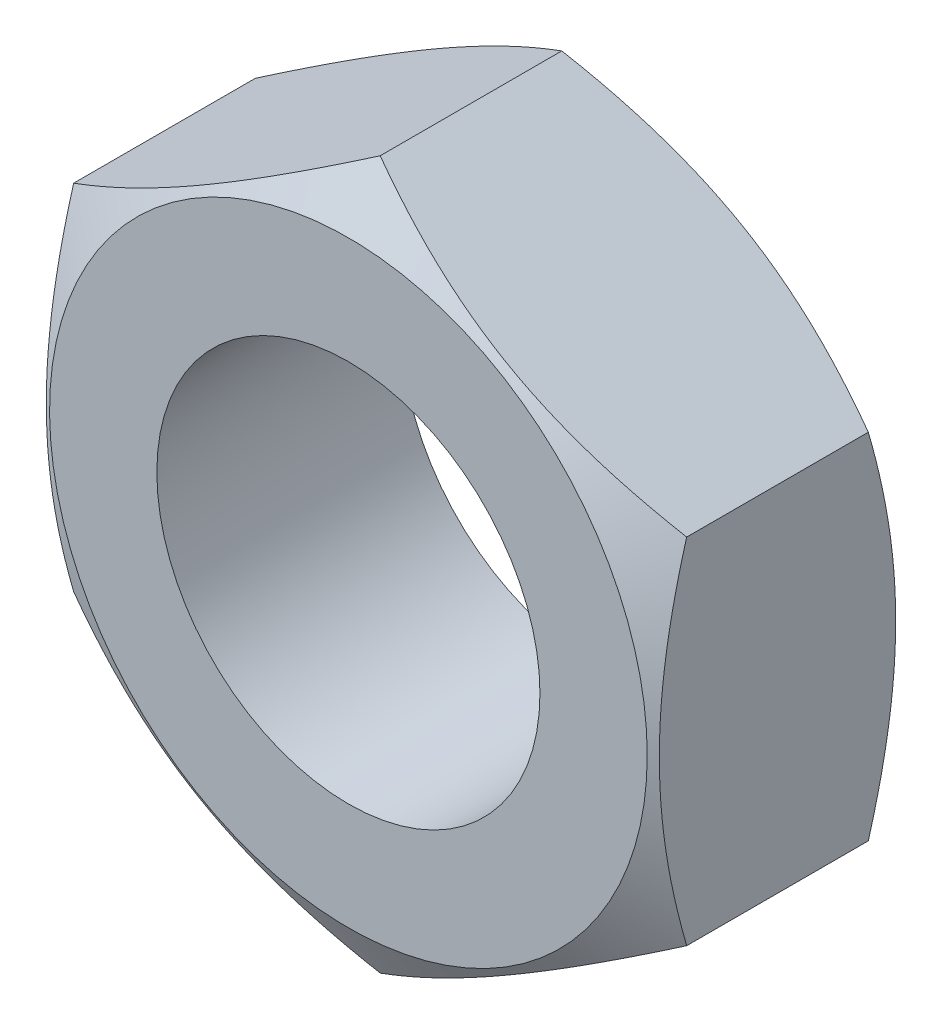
ISO-10303-21;
HEADER;
FILE_DESCRIPTION(('STEP AP214'),'2;1');
FILE_NAME('part.step','',(''),(''),'','','');
FILE_SCHEMA(('AUTOMOTIVE_DESIGN { 1 0 10303 214 1 1 1 1 }'));
ENDSEC;
DATA;
#1=APPLICATION_CONTEXT('core data for automotive mechanical design processes');
#2=APPLICATION_PROTOCOL_DEFINITION('international standard','automotive_design',2000,#1);
#3=PRODUCT_CONTEXT('',#1,'mechanical');
#4=PRODUCT('Part','Part','',(#3));
#5=PRODUCT_RELATED_PRODUCT_CATEGORY('part','',(#4));
#6=PRODUCT_DEFINITION_FORMATION('','',#4);
#7=PRODUCT_DEFINITION_CONTEXT('part definition',#1,'design');
#8=PRODUCT_DEFINITION('design','',#6,#7);
#9=PRODUCT_DEFINITION_SHAPE('','',#8);
#10=(LENGTH_UNIT() NAMED_UNIT(*) SI_UNIT(.MILLI.,.METRE.));
#11=(NAMED_UNIT(*) PLANE_ANGLE_UNIT() SI_UNIT($,.RADIAN.));
#12=(NAMED_UNIT(*) SI_UNIT($,.STERADIAN.) SOLID_ANGLE_UNIT());
#13=UNCERTAINTY_MEASURE_WITH_UNIT(LENGTH_MEASURE(1.E-05),#10,'distance_accuracy_value','');
#14=(GEOMETRIC_REPRESENTATION_CONTEXT(3) GLOBAL_UNCERTAINTY_ASSIGNED_CONTEXT((#13)) GLOBAL_UNIT_ASSIGNED_CONTEXT((#10,
#11,#12)) REPRESENTATION_CONTEXT('',''));
#15=CARTESIAN_POINT('',(0.,0.,0.));
#16=DIRECTION('',(0.,0.,1.));
#17=DIRECTION('',(1.,0.,0.));
#18=AXIS2_PLACEMENT_3D('',#15,#16,#17);
#19=CARTESIAN_POINT('',(4.,2.30940107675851,3.2));
#20=DIRECTION('',(-0.5,-0.866025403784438,0.));
#21=DIRECTION('',(0.866025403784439,-0.5,0.));
#22=AXIS2_PLACEMENT_3D('',#19,#20,#21);
#23=PLANE('',#22);
#24=CARTESIAN_POINT('',(-0.000199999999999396,4.61891762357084,0.415067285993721));
#25=CARTESIAN_POINT('',(0.17557915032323,4.5174314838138,0.356452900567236));
#26=CARTESIAN_POINT('',(0.352875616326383,4.41506932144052,0.303145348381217));
#27=CARTESIAN_POINT('',(0.710538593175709,4.2085725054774,0.210096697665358));
#28=CARTESIAN_POINT('',(0.890911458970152,4.10443418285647,0.170388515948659));
#29=CARTESIAN_POINT('',(1.24942181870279,3.89744813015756,0.108577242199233));
#30=CARTESIAN_POINT('',(1.42750415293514,3.7946322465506,0.0860627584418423));
#31=CARTESIAN_POINT('',(1.78450671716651,3.58851671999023,0.0591856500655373));
#32=CARTESIAN_POINT('',(1.96342564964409,3.48521782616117,0.0548007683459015));
#33=CARTESIAN_POINT('',(2.29774284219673,3.29219970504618,0.0639250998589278));
#34=CARTESIAN_POINT('',(2.45319115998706,3.20245157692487,0.0751939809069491));
#35=CARTESIAN_POINT('',(2.76307505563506,3.02354002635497,0.110909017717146));
#36=CARTESIAN_POINT('',(2.91750956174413,2.93437722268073,0.135367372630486));
#37=CARTESIAN_POINT('',(3.22803232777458,2.75509682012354,0.196511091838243));
#38=CARTESIAN_POINT('',(3.3840812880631,2.6650019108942,0.233455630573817));
#39=CARTESIAN_POINT('',(3.69385183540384,2.48615580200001,0.31730509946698));
#40=CARTESIAN_POINT('',(3.84757739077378,2.39740231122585,0.364190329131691));
#41=CARTESIAN_POINT('',(4.0002,2.30928560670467,0.415067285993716));
#42=B_SPLINE_CURVE_WITH_KNOTS('',3,(#24,#25,#26,#27,#28,#29,#30,#31,#32,#33,#34,#35,#36,#37,#38,
#39,#40,#41),.UNSPECIFIED.,.F.,.F.,(4,2,2,2,2,2,2,2,4),(0.,0.634047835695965,1.26961969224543,
1.88946157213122,2.50854226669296,3.04757825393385,3.58711366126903,4.13861653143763,
4.68903648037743),.UNSPECIFIED.);
#43=CARTESIAN_POINT('',(0.,4.618802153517,0.415000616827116));
#44=VERTEX_POINT('',#43);
#45=CARTESIAN_POINT('',(4.,2.30940107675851,0.415000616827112));
#46=VERTEX_POINT('',#45);
#47=EDGE_CURVE('E35',#44,#46,#42,.T.);
#48=ORIENTED_EDGE('',*,*,#47,.F.);
#49=DIRECTION('',(0.,0.,-1.));
#50=VECTOR('',#49,1.);
#51=CARTESIAN_POINT('',(0.,4.618802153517,3.2));
#52=LINE('',#51,#50);
#53=CARTESIAN_POINT('',(0.,4.618802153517,2.78499938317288));
#54=VERTEX_POINT('',#53);
#55=EDGE_CURVE('E28',#54,#44,#52,.T.);
#56=ORIENTED_EDGE('',*,*,#55,.F.);
#57=CARTESIAN_POINT('',(4.0002,2.30928560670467,2.78493271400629));
#58=CARTESIAN_POINT('',(3.82442084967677,2.41077174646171,2.84354709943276));
#59=CARTESIAN_POINT('',(3.64712438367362,2.513133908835,2.89685465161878));
#60=CARTESIAN_POINT('',(3.28946140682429,2.71963072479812,2.98990330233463));
#61=CARTESIAN_POINT('',(3.10908854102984,2.82376904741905,3.02961148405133));
#62=CARTESIAN_POINT('',(2.75057818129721,3.03075510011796,3.09142275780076));
#63=CARTESIAN_POINT('',(2.57249584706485,3.13357098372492,3.11393724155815));
#64=CARTESIAN_POINT('',(2.21549328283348,3.33968651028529,3.14081434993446));
#65=CARTESIAN_POINT('',(2.03657435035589,3.44298540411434,3.1451992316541));
#66=CARTESIAN_POINT('',(1.70225715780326,3.63600352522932,3.13607490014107));
#67=CARTESIAN_POINT('',(1.54680884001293,3.72575165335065,3.12480601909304));
#68=CARTESIAN_POINT('',(1.23692494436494,3.90466320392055,3.08909098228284));
#69=CARTESIAN_POINT('',(1.08249043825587,3.99382600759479,3.0646326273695));
#70=CARTESIAN_POINT('',(0.771967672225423,4.17310641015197,3.00348890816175));
#71=CARTESIAN_POINT('',(0.6159187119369,4.26320131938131,2.96654436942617));
#72=CARTESIAN_POINT('',(0.306148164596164,4.4420474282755,2.88269490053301));
#73=CARTESIAN_POINT('',(0.152422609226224,4.53080091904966,2.8358096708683));
#74=CARTESIAN_POINT('',(-0.000199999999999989,4.61891762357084,2.78493271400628));
#75=B_SPLINE_CURVE_WITH_KNOTS('',3,(#57,#58,#59,#60,#61,#62,#63,#64,#65,#66,#67,#68,#69,#70,#71,
#72,#73,#74),.UNSPECIFIED.,.F.,.F.,(4,2,2,2,2,2,2,2,4),(0.,0.634047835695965,1.26961969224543,
1.88946157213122,2.50854226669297,3.04757825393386,3.58711366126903,4.13861653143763,
4.68903648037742),.UNSPECIFIED.);
#76=CARTESIAN_POINT('',(4.,2.30940107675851,2.78499938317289));
#77=VERTEX_POINT('',#76);
#78=EDGE_CURVE('E113',#77,#54,#75,.T.);
#79=ORIENTED_EDGE('',*,*,#78,.F.);
#80=DIRECTION('',(0.,0.,-1.));
#81=VECTOR('',#80,1.);
#82=CARTESIAN_POINT('',(4.,2.30940107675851,3.2));
#83=LINE('',#82,#81);
#84=EDGE_CURVE('E90',#77,#46,#83,.T.);
#85=ORIENTED_EDGE('',*,*,#84,.T.);
#86=EDGE_LOOP('',(#48,#56,#79,#85));
#87=FACE_BOUND('',#86,.T.);
#88=ADVANCED_FACE('F14',(#87),#23,.F.);
#89=CARTESIAN_POINT('',(0.,4.618802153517,3.2));
#90=DIRECTION('',(0.5,-0.866025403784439,0.));
#91=DIRECTION('',(0.866025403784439,0.5,0.));
#92=AXIS2_PLACEMENT_3D('',#89,#90,#91);
#93=PLANE('',#92);
#94=CARTESIAN_POINT('',(-4.0002,2.30928560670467,0.415067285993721));
#95=CARTESIAN_POINT('',(-3.82442084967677,2.4107717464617,0.356452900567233));
#96=CARTESIAN_POINT('',(-3.64712438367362,2.51313390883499,0.303145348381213));
#97=CARTESIAN_POINT('',(-3.28946140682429,2.71963072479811,0.210096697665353));
#98=CARTESIAN_POINT('',(-3.10908854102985,2.82376904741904,0.170388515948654));
#99=CARTESIAN_POINT('',(-2.75057818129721,3.03075510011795,0.108577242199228));
#100=CARTESIAN_POINT('',(-2.57249584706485,3.13357098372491,0.086062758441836));
#101=CARTESIAN_POINT('',(-2.21549328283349,3.33968651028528,0.0591856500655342));
#102=CARTESIAN_POINT('',(-2.0365743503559,3.44298540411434,0.0548007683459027));
#103=CARTESIAN_POINT('',(-1.70225715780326,3.63600352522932,0.0639250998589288));
#104=CARTESIAN_POINT('',(-1.54680884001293,3.72575165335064,0.0751939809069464));
#105=CARTESIAN_POINT('',(-1.23692494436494,3.90466320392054,0.110909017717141));
#106=CARTESIAN_POINT('',(-1.08249043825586,3.99382600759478,0.135367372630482));
#107=CARTESIAN_POINT('',(-0.771967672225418,4.17310641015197,0.19651109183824));
#108=CARTESIAN_POINT('',(-0.615918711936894,4.26320131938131,0.233455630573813));
#109=CARTESIAN_POINT('',(-0.306148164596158,4.4420474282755,0.317305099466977));
#110=CARTESIAN_POINT('',(-0.152422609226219,4.53080091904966,0.364190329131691));
#111=CARTESIAN_POINT('',(0.000200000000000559,4.61891762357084,0.415067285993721));
#112=B_SPLINE_CURVE_WITH_KNOTS('',3,(#94,#95,#96,#97,#98,#99,#100,#101,#102,#103,#104,#105,#106,
#107,#108,#109,#110,#111),.UNSPECIFIED.,.F.,.F.,(4,2,2,2,2,2,2,2,4),(0.,0.634047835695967,
1.26961969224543,1.88946157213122,2.50854226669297,3.04757825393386,3.58711366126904,
4.13861653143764,4.68903648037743),.UNSPECIFIED.);
#113=CARTESIAN_POINT('',(-4.,2.30940107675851,0.415000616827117));
#114=VERTEX_POINT('',#113);
#115=EDGE_CURVE('E109',#114,#44,#112,.T.);
#116=ORIENTED_EDGE('',*,*,#115,.F.);
#117=DIRECTION('',(0.,0.,-1.));
#118=VECTOR('',#117,1.);
#119=CARTESIAN_POINT('',(-4.,2.30940107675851,3.2));
#120=LINE('',#119,#118);
#121=CARTESIAN_POINT('',(-4.,2.30940107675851,2.78499938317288));
#122=VERTEX_POINT('',#121);
#123=EDGE_CURVE('E100',#122,#114,#120,.T.);
#124=ORIENTED_EDGE('',*,*,#123,.F.);
#125=CARTESIAN_POINT('',(0.000200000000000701,4.61891762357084,2.78493271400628));
#126=CARTESIAN_POINT('',(-0.175579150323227,4.5174314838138,2.84354709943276));
#127=CARTESIAN_POINT('',(-0.35287561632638,4.41506932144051,2.89685465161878));
#128=CARTESIAN_POINT('',(-0.710538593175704,4.20857250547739,2.98990330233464));
#129=CARTESIAN_POINT('',(-0.890911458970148,4.10443418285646,3.02961148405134));
#130=CARTESIAN_POINT('',(-1.24942181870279,3.89744813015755,3.09142275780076));
#131=CARTESIAN_POINT('',(-1.42750415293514,3.79463224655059,3.11393724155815));
#132=CARTESIAN_POINT('',(-1.7845067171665,3.58851671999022,3.14081434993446));
#133=CARTESIAN_POINT('',(-1.9634256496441,3.48521782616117,3.1451992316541));
#134=CARTESIAN_POINT('',(-2.29774284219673,3.29219970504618,3.13607490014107));
#135=CARTESIAN_POINT('',(-2.45319115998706,3.20245157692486,3.12480601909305));
#136=CARTESIAN_POINT('',(-2.76307505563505,3.02354002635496,3.08909098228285));
#137=CARTESIAN_POINT('',(-2.91750956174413,2.93437722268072,3.06463262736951));
#138=CARTESIAN_POINT('',(-3.22803232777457,2.75509682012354,3.00348890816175));
#139=CARTESIAN_POINT('',(-3.3840812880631,2.6650019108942,2.96654436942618));
#140=CARTESIAN_POINT('',(-3.69385183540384,2.486155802,2.88269490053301));
#141=CARTESIAN_POINT('',(-3.84757739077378,2.39740231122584,2.8358096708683));
#142=CARTESIAN_POINT('',(-4.0002,2.30928560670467,2.78493271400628));
#143=B_SPLINE_CURVE_WITH_KNOTS('',3,(#125,#126,#127,#128,#129,#130,#131,#132,#133,#134,#135,
#136,#137,#138,#139,#140,#141,#142),.UNSPECIFIED.,.F.,.F.,(4,2,2,2,2,2,2,2,4),(0.,
0.634047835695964,1.26961969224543,1.88946157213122,2.50854226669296,3.04757825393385,
3.58711366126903,4.13861653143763,4.68903648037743),.UNSPECIFIED.);
#144=EDGE_CURVE('E110',#54,#122,#143,.T.);
#145=ORIENTED_EDGE('',*,*,#144,.F.);
#146=ORIENTED_EDGE('',*,*,#55,.T.);
#147=EDGE_LOOP('',(#116,#124,#145,#146));
#148=FACE_BOUND('',#147,.T.);
#149=ADVANCED_FACE('F107',(#148),#93,.F.);
#150=CARTESIAN_POINT('',(-4.,2.30940107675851,3.2));
#151=DIRECTION('',(1.,0.,0.));
#152=DIRECTION('',(0.,0.,-1.));
#153=AXIS2_PLACEMENT_3D('',#150,#151,#152);
#154=PLANE('',#153);
#155=CARTESIAN_POINT('',(-4.,-6.17590324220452,1.99654066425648));
#156=CARTESIAN_POINT('',(-4.,-6.00142542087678,1.91201394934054));
#157=CARTESIAN_POINT('',(-4.,-5.82654411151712,1.82830568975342));
#158=CARTESIAN_POINT('',(-4.,-5.47575983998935,1.66298695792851));
#159=CARTESIAN_POINT('',(-4.,-5.2998567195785,1.58137682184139));
#160=CARTESIAN_POINT('',(-4.,-4.94589460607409,1.42029874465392));
#161=CARTESIAN_POINT('',(-4.,-4.76782907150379,1.34084512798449));
#162=CARTESIAN_POINT('',(-4.,-4.41027208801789,1.18522627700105));
#163=CARTESIAN_POINT('',(-4.,-4.23078070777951,1.10906088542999));
#164=CARTESIAN_POINT('',(-4.,-3.86439909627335,0.958551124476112));
#165=CARTESIAN_POINT('',(-4.,-3.67745393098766,0.884339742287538));
#166=CARTESIAN_POINT('',(-4.,-3.30136630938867,0.741600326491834));
#167=CARTESIAN_POINT('',(-4.,-3.11222360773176,0.673072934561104));
#168=CARTESIAN_POINT('',(-4.,-2.73180305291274,0.543520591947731));
#169=CARTESIAN_POINT('',(-4.,-2.54053050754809,0.482480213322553));
#170=CARTESIAN_POINT('',(-4.,-2.15524197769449,0.369878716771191));
#171=CARTESIAN_POINT('',(-4.,-1.96122688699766,0.318314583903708));
#172=CARTESIAN_POINT('',(-4.,-1.57141523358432,0.227431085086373));
#173=CARTESIAN_POINT('',(-4.,-1.37563420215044,0.188046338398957));
#174=CARTESIAN_POINT('',(-4.,-0.981666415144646,0.123766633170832));
#175=CARTESIAN_POINT('',(-4.,-0.783479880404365,0.0988703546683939));
#176=CARTESIAN_POINT('',(-4.,-0.388268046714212,0.0658801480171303));
#177=CARTESIAN_POINT('',(-4.,-0.191261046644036,0.0575723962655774));
#178=CARTESIAN_POINT('',(-4.,0.202753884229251,0.0579024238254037));
#179=CARTESIAN_POINT('',(-4.,0.399761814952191,0.0665405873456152));
#180=CARTESIAN_POINT('',(-4.,0.735042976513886,0.095054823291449));
#181=CARTESIAN_POINT('',(-4.,0.87367778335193,0.110915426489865));
#182=CARTESIAN_POINT('',(-4.,1.14990838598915,0.150025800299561));
#183=CARTESIAN_POINT('',(-4.,1.28750403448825,0.173276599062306));
#184=CARTESIAN_POINT('',(-4.,1.69856274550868,0.252889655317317));
#185=CARTESIAN_POINT('',(-4.,1.97013891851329,0.319097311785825));
#186=CARTESIAN_POINT('',(-4.,2.37618130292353,0.433594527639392));
#187=CARTESIAN_POINT('',(-4.,2.51276006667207,0.47481634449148));
#188=CARTESIAN_POINT('',(-4.,2.78459027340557,0.561464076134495));
#189=CARTESIAN_POINT('',(-4.,2.91984170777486,0.606890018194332));
#190=CARTESIAN_POINT('',(-4.,3.18906161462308,0.701223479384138));
#191=CARTESIAN_POINT('',(-4.,3.32303051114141,0.750129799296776));
#192=CARTESIAN_POINT('',(-4.,3.58986358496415,0.850856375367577));
#193=CARTESIAN_POINT('',(-4.,3.7227277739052,0.902676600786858));
#194=CARTESIAN_POINT('',(-4.,4.03085022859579,1.0261238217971));
#195=CARTESIAN_POINT('',(-4.,4.20573640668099,1.0986777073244));
#196=CARTESIAN_POINT('',(-4.,4.55406619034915,1.24717850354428));
#197=CARTESIAN_POINT('',(-4.,4.72750971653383,1.32312559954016));
#198=CARTESIAN_POINT('',(-4.,5.07321310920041,1.47774583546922));
#199=CARTESIAN_POINT('',(-4.,5.24547274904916,1.55641948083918));
#200=CARTESIAN_POINT('',(-4.,5.58897335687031,1.71596322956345));
#201=CARTESIAN_POINT('',(-4.,5.7602143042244,1.79683337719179));
#202=CARTESIAN_POINT('',(-4.,6.2729771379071,2.04226306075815));
#203=CARTESIAN_POINT('',(-4.,6.61321847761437,2.20949654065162));
#204=CARTESIAN_POINT('',(-4.,7.2912669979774,2.54882557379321));
#205=CARTESIAN_POINT('',(-4.,7.6290740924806,2.72092129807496));
#206=CARTESIAN_POINT('',(-4.,8.27551390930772,3.05445861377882));
#207=CARTESIAN_POINT('',(-4.,8.58428657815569,3.21562947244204));
#208=CARTESIAN_POINT('',(-4.,9.20067845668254,3.54018258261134));
#209=CARTESIAN_POINT('',(-4.,9.50829762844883,3.70356490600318));
#210=CARTESIAN_POINT('',(-4.,10.1219056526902,4.03163342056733));
#211=CARTESIAN_POINT('',(-4.,10.4278966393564,4.19631562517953));
#212=CARTESIAN_POINT('',(-4.,11.0391377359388,4.52701177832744));
#213=CARTESIAN_POINT('',(-4.,11.3443878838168,4.69302565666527));
#214=CARTESIAN_POINT('',(-4.,11.6493637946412,4.85953818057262));
#215=B_SPLINE_CURVE_WITH_KNOTS('',3,(#155,#156,#157,#158,#159,#160,#161,#162,#163,#164,#165,
#166,#167,#168,#169,#170,#171,#172,#173,#174,#175,#176,#177,#178,#179,#180,#181,#182,#183,#184,
#185,#186,#187,#188,#189,#190,#191,#192,#193,#194,#195,#196,#197,#198,#199,#200,#201,#202,#203,
#204,#205,#206,#207,#208,#209,#210,#211,#212,#213,#214),.UNSPECIFIED.,.F.,.F.,(4,2,2,2,2,2,2,2,
2,2,2,2,2,2,2,2,2,2,2,2,2,2,2,2,2,2,2,2,2,4),(0.,0.581630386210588,1.16335338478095,
1.7482899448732,2.3331984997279,2.93653608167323,3.53994168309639,4.14208222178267,
4.74403085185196,5.34268967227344,5.94129394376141,6.53213116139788,7.12298177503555,
7.54139562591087,7.95986771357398,8.79728788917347,9.22524445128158,9.65320378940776,
10.0810163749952,10.5088244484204,11.0767936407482,11.6447938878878,12.2128999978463,
12.7810175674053,13.9183082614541,15.0556390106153,16.1005432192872,17.1454814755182,
18.1879539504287,19.2303718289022),.UNSPECIFIED.);
#216=CARTESIAN_POINT('',(-4.,-2.30940107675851,0.415000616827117));
#217=VERTEX_POINT('',#216);
#218=EDGE_CURVE('E118',#217,#114,#215,.T.);
#219=ORIENTED_EDGE('',*,*,#218,.F.);
#220=DIRECTION('',(0.,0.,-1.));
#221=VECTOR('',#220,1.);
#222=CARTESIAN_POINT('',(-4.,-2.30940107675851,3.2));
#223=LINE('',#222,#221);
#224=CARTESIAN_POINT('',(-4.,-2.30940107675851,2.78499938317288));
#225=VERTEX_POINT('',#224);
#226=EDGE_CURVE('E92',#225,#217,#223,.T.);
#227=ORIENTED_EDGE('',*,*,#226,.F.);
#228=CARTESIAN_POINT('',(-4.,-6.17590324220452,1.20345933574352));
#229=CARTESIAN_POINT('',(-4.,-6.00142542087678,1.28798605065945));
#230=CARTESIAN_POINT('',(-4.,-5.82654411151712,1.37169431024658));
#231=CARTESIAN_POINT('',(-4.,-5.47575983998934,1.53701304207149));
#232=CARTESIAN_POINT('',(-4.,-5.2998567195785,1.6186231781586));
#233=CARTESIAN_POINT('',(-4.,-4.94589460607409,1.77970125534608));
#234=CARTESIAN_POINT('',(-4.,-4.76782907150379,1.8591548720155));
#235=CARTESIAN_POINT('',(-4.,-4.41027208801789,2.01477372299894));
#236=CARTESIAN_POINT('',(-4.,-4.23078070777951,2.09093911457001));
#237=CARTESIAN_POINT('',(-4.,-3.86439909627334,2.24144887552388));
#238=CARTESIAN_POINT('',(-4.,-3.67745393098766,2.31566025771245));
#239=CARTESIAN_POINT('',(-4.,-3.30136630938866,2.45839967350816));
#240=CARTESIAN_POINT('',(-4.,-3.11222360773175,2.52692706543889));
#241=CARTESIAN_POINT('',(-4.,-2.73180305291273,2.65647940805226));
#242=CARTESIAN_POINT('',(-4.,-2.54053050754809,2.71751978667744));
#243=CARTESIAN_POINT('',(-4.,-2.15524197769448,2.8301212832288));
#244=CARTESIAN_POINT('',(-4.,-1.96122688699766,2.88168541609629));
#245=CARTESIAN_POINT('',(-4.,-1.57141523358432,2.97256891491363));
#246=CARTESIAN_POINT('',(-4.,-1.37563420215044,3.01195366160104));
#247=CARTESIAN_POINT('',(-4.,-0.981666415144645,3.07623336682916));
#248=CARTESIAN_POINT('',(-4.,-0.783479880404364,3.1011296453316));
#249=CARTESIAN_POINT('',(-4.,-0.388268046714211,3.13411985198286));
#250=CARTESIAN_POINT('',(-4.,-0.191261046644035,3.14242760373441));
#251=CARTESIAN_POINT('',(-4.,0.202753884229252,3.14209757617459));
#252=CARTESIAN_POINT('',(-4.,0.399761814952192,3.13345941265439));
#253=CARTESIAN_POINT('',(-4.,0.735042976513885,3.10494517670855));
#254=CARTESIAN_POINT('',(-4.,0.873677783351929,3.08908457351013));
#255=CARTESIAN_POINT('',(-4.,1.14990838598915,3.04997419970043));
#256=CARTESIAN_POINT('',(-4.,1.28750403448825,3.02672340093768));
#257=CARTESIAN_POINT('',(-4.,1.69856274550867,2.94711034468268));
#258=CARTESIAN_POINT('',(-4.,1.97013891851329,2.88090268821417));
#259=CARTESIAN_POINT('',(-4.,2.37618130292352,2.7664054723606));
#260=CARTESIAN_POINT('',(-4.,2.51276006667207,2.72518365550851));
#261=CARTESIAN_POINT('',(-4.,2.78459027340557,2.6385359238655));
#262=CARTESIAN_POINT('',(-4.,2.91984170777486,2.59310998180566));
#263=CARTESIAN_POINT('',(-4.,3.18906161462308,2.49877652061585));
#264=CARTESIAN_POINT('',(-4.,3.3230305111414,2.44987020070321));
#265=CARTESIAN_POINT('',(-4.,3.58986358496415,2.34914362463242));
#266=CARTESIAN_POINT('',(-4.,3.7227277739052,2.29732339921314));
#267=CARTESIAN_POINT('',(-4.,4.03085022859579,2.1738761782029));
#268=CARTESIAN_POINT('',(-4.,4.20573640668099,2.1013222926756));
#269=CARTESIAN_POINT('',(-4.,4.55406619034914,1.95282149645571));
#270=CARTESIAN_POINT('',(-4.,4.72750971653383,1.87687440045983));
#271=CARTESIAN_POINT('',(-4.,5.07321310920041,1.72225416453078));
#272=CARTESIAN_POINT('',(-4.,5.24547274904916,1.64358051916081));
#273=CARTESIAN_POINT('',(-4.,5.58897335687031,1.48403677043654));
#274=CARTESIAN_POINT('',(-4.,5.76021430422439,1.40316662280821));
#275=CARTESIAN_POINT('',(-4.,6.2729771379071,1.15773693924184));
#276=CARTESIAN_POINT('',(-4.,6.61321847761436,0.990503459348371));
#277=CARTESIAN_POINT('',(-4.,7.29126699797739,0.651174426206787));
#278=CARTESIAN_POINT('',(-4.,7.6290740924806,0.479078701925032));
#279=CARTESIAN_POINT('',(-4.,8.27551390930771,0.145541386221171));
#280=CARTESIAN_POINT('',(-4.,8.58428657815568,-0.0156294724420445));
#281=CARTESIAN_POINT('',(-4.,9.20067845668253,-0.34018258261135));
#282=CARTESIAN_POINT('',(-4.,9.50829762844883,-0.503564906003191));
#283=CARTESIAN_POINT('',(-4.,10.1219056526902,-0.831633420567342));
#284=CARTESIAN_POINT('',(-4.,10.4278966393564,-0.996315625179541));
#285=CARTESIAN_POINT('',(-4.,11.0391377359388,-1.32701177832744));
#286=CARTESIAN_POINT('',(-4.,11.3443878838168,-1.49302565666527));
#287=CARTESIAN_POINT('',(-4.,11.6493637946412,-1.65953818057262));
#288=B_SPLINE_CURVE_WITH_KNOTS('',3,(#228,#229,#230,#231,#232,#233,#234,#235,#236,#237,#238,
#239,#240,#241,#242,#243,#244,#245,#246,#247,#248,#249,#250,#251,#252,#253,#254,#255,#256,#257,
#258,#259,#260,#261,#262,#263,#264,#265,#266,#267,#268,#269,#270,#271,#272,#273,#274,#275,#276,
#277,#278,#279,#280,#281,#282,#283,#284,#285,#286,#287),.UNSPECIFIED.,.F.,.F.,(4,2,2,2,2,2,2,2,
2,2,2,2,2,2,2,2,2,2,2,2,2,2,2,2,2,2,2,2,2,4),(0.,0.581630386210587,1.16335338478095,
1.7482899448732,2.3331984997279,2.93653608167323,3.53994168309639,4.14208222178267,
4.74403085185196,5.34268967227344,5.94129394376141,6.53213116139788,7.12298177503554,
7.54139562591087,7.95986771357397,8.79728788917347,9.22524445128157,9.65320378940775,
10.0810163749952,10.5088244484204,11.0767936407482,11.6447938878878,12.2128999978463,
12.7810175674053,13.9183082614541,15.0556390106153,16.1005432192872,17.1454814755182,
18.1879539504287,19.2303718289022),.UNSPECIFIED.);
#289=EDGE_CURVE('E172',#122,#225,#288,.F.);
#290=ORIENTED_EDGE('',*,*,#289,.F.);
#291=ORIENTED_EDGE('',*,*,#123,.T.);
#292=EDGE_LOOP('',(#219,#227,#290,#291));
#293=FACE_BOUND('',#292,.T.);
#294=ADVANCED_FACE('F163',(#293),#154,.F.);
#295=CARTESIAN_POINT('',(-4.,-2.30940107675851,3.2));
#296=DIRECTION('',(0.5,0.866025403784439,0.));
#297=DIRECTION('',(-0.866025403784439,0.5,0.));
#298=AXIS2_PLACEMENT_3D('',#295,#296,#297);
#299=PLANE('',#298);
#300=CARTESIAN_POINT('',(0.0002000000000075,-4.61891762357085,0.415067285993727));
#301=CARTESIAN_POINT('',(-0.17557915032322,-4.51743148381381,0.35645290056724));
#302=CARTESIAN_POINT('',(-0.352875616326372,-4.41506932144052,0.303145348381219));
#303=CARTESIAN_POINT('',(-0.710538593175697,-4.2085725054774,0.210096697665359));
#304=CARTESIAN_POINT('',(-0.890911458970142,-4.10443418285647,0.17038851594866));
#305=CARTESIAN_POINT('',(-1.24942181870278,-3.89744813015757,0.108577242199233));
#306=CARTESIAN_POINT('',(-1.42750415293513,-3.7946322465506,0.0860627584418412));
#307=CARTESIAN_POINT('',(-1.7845067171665,-3.58851671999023,0.0591856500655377));
#308=CARTESIAN_POINT('',(-1.96342564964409,-3.48521782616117,0.0548007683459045));
#309=CARTESIAN_POINT('',(-2.29774284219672,-3.29219970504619,0.0639250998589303));
#310=CARTESIAN_POINT('',(-2.45319115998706,-3.20245157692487,0.0751939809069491));
#311=CARTESIAN_POINT('',(-2.76307505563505,-3.02354002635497,0.110909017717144));
#312=CARTESIAN_POINT('',(-2.91750956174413,-2.93437722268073,0.135367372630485));
#313=CARTESIAN_POINT('',(-3.22803232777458,-2.75509682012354,0.196511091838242));
#314=CARTESIAN_POINT('',(-3.3840812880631,-2.6650019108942,0.233455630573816));
#315=CARTESIAN_POINT('',(-3.69385183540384,-2.48615580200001,0.31730509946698));
#316=CARTESIAN_POINT('',(-3.84757739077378,-2.39740231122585,0.364190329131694));
#317=CARTESIAN_POINT('',(-4.0002,-2.30928560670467,0.415067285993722));
#318=B_SPLINE_CURVE_WITH_KNOTS('',3,(#300,#301,#302,#303,#304,#305,#306,#307,#308,#309,#310,
#311,#312,#313,#314,#315,#316,#317),.UNSPECIFIED.,.F.,.F.,(4,2,2,2,2,2,2,2,4),(0.,
0.634047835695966,1.26961969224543,1.88946157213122,2.50854226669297,3.04757825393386,
3.58711366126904,4.13861653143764,4.68903648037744),.UNSPECIFIED.);
#319=CARTESIAN_POINT('',(0.,-4.61880215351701,0.415000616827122));
#320=VERTEX_POINT('',#319);
#321=EDGE_CURVE('E87',#320,#217,#318,.T.);
#322=ORIENTED_EDGE('',*,*,#321,.F.);
#323=DIRECTION('',(0.,0.,-1.));
#324=VECTOR('',#323,1.);
#325=CARTESIAN_POINT('',(0.,-4.61880215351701,3.2));
#326=LINE('',#325,#324);
#327=CARTESIAN_POINT('',(0.,-4.61880215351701,2.78499938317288));
#328=VERTEX_POINT('',#327);
#329=EDGE_CURVE('E86',#328,#320,#326,.T.);
#330=ORIENTED_EDGE('',*,*,#329,.F.);
#331=CARTESIAN_POINT('',(-4.0002,-2.30928560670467,2.78493271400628));
#332=CARTESIAN_POINT('',(-3.82442084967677,-2.41077174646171,2.84354709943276));
#333=CARTESIAN_POINT('',(-3.64712438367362,-2.513133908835,2.89685465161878));
#334=CARTESIAN_POINT('',(-3.28946140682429,-2.71963072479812,2.98990330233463));
#335=CARTESIAN_POINT('',(-3.10908854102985,-2.82376904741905,3.02961148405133));
#336=CARTESIAN_POINT('',(-2.75057818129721,-3.03075510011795,3.09142275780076));
#337=CARTESIAN_POINT('',(-2.57249584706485,-3.13357098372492,3.11393724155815));
#338=CARTESIAN_POINT('',(-2.21549328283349,-3.33968651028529,3.14081434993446));
#339=CARTESIAN_POINT('',(-2.03657435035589,-3.44298540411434,3.1451992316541));
#340=CARTESIAN_POINT('',(-1.70225715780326,-3.63600352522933,3.13607490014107));
#341=CARTESIAN_POINT('',(-1.54680884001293,-3.72575165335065,3.12480601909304));
#342=CARTESIAN_POINT('',(-1.23692494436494,-3.90466320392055,3.08909098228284));
#343=CARTESIAN_POINT('',(-1.08249043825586,-3.99382600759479,3.0646326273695));
#344=CARTESIAN_POINT('',(-0.771967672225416,-4.17310641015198,3.00348890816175));
#345=CARTESIAN_POINT('',(-0.615918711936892,-4.26320131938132,2.96654436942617));
#346=CARTESIAN_POINT('',(-0.306148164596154,-4.44204742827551,2.88269490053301));
#347=CARTESIAN_POINT('',(-0.152422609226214,-4.53080091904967,2.8358096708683));
#348=CARTESIAN_POINT('',(0.000200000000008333,-4.61891762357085,2.78493271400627));
#349=B_SPLINE_CURVE_WITH_KNOTS('',3,(#331,#332,#333,#334,#335,#336,#337,#338,#339,#340,#341,
#342,#343,#344,#345,#346,#347,#348),.UNSPECIFIED.,.F.,.F.,(4,2,2,2,2,2,2,2,4),(0.,
0.634047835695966,1.26961969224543,1.88946157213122,2.50854226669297,3.04757825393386,
3.58711366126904,4.13861653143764,4.68903648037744),.UNSPECIFIED.);
#350=EDGE_CURVE('E179',#225,#328,#349,.T.);
#351=ORIENTED_EDGE('',*,*,#350,.F.);
#352=ORIENTED_EDGE('',*,*,#226,.T.);
#353=EDGE_LOOP('',(#322,#330,#351,#352));
#354=FACE_BOUND('',#353,.T.);
#355=ADVANCED_FACE('F166',(#354),#299,.F.);
#356=CARTESIAN_POINT('',(0.,-4.61880215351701,3.2));
#357=DIRECTION('',(-0.5,0.866025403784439,0.));
#358=DIRECTION('',(-0.866025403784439,-0.5,0.));
#359=AXIS2_PLACEMENT_3D('',#356,#357,#358);
#360=PLANE('',#359);
#361=CARTESIAN_POINT('',(4.0002,-2.30928560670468,0.415067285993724));
#362=CARTESIAN_POINT('',(3.82442084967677,-2.41077174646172,0.356452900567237));
#363=CARTESIAN_POINT('',(3.64712438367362,-2.51313390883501,0.303145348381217));
#364=CARTESIAN_POINT('',(3.28946140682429,-2.71963072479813,0.210096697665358));
#365=CARTESIAN_POINT('',(3.10908854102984,-2.82376904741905,0.17038851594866));
#366=CARTESIAN_POINT('',(2.7505781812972,-3.03075510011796,0.108577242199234));
#367=CARTESIAN_POINT('',(2.57249584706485,-3.13357098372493,0.0860627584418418));
#368=CARTESIAN_POINT('',(2.21549328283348,-3.3396865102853,0.0591856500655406));
#369=CARTESIAN_POINT('',(2.03657435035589,-3.44298540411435,0.0548007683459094));
#370=CARTESIAN_POINT('',(1.70225715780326,-3.63600352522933,0.0639250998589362));
#371=CARTESIAN_POINT('',(1.54680884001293,-3.72575165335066,0.0751939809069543));
#372=CARTESIAN_POINT('',(1.23692494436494,-3.90466320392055,0.110909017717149));
#373=CARTESIAN_POINT('',(1.08249043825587,-3.99382600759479,0.13536737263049));
#374=CARTESIAN_POINT('',(0.77196767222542,-4.17310641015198,0.196511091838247));
#375=CARTESIAN_POINT('',(0.615918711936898,-4.26320131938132,0.23345563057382));
#376=CARTESIAN_POINT('',(0.306148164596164,-4.44204742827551,0.317305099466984));
#377=CARTESIAN_POINT('',(0.152422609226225,-4.53080091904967,0.364190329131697));
#378=CARTESIAN_POINT('',(-0.000199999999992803,-4.61891762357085,0.415067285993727));
#379=B_SPLINE_CURVE_WITH_KNOTS('',3,(#361,#362,#363,#364,#365,#366,#367,#368,#369,#370,#371,
#372,#373,#374,#375,#376,#377,#378),.UNSPECIFIED.,.F.,.F.,(4,2,2,2,2,2,2,2,4),(0.,
0.634047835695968,1.26961969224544,1.88946157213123,2.50854226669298,3.04757825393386,
3.58711366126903,4.13861653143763,4.68903648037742),.UNSPECIFIED.);
#380=CARTESIAN_POINT('',(4.,-2.30940107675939,0.415000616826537));
#381=VERTEX_POINT('',#380);
#382=EDGE_CURVE('E72',#381,#320,#379,.T.);
#383=ORIENTED_EDGE('',*,*,#382,.F.);
#384=DIRECTION('',(0.,0.,-1.));
#385=VECTOR('',#384,1.);
#386=CARTESIAN_POINT('',(4.,-2.30940107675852,3.2));
#387=LINE('',#386,#385);
#388=CARTESIAN_POINT('',(4.,-2.30940107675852,2.78499938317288));
#389=VERTEX_POINT('',#388);
#390=EDGE_CURVE('E84',#389,#381,#387,.T.);
#391=ORIENTED_EDGE('',*,*,#390,.F.);
#392=CARTESIAN_POINT('',(-0.000199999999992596,-4.61891762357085,2.78493271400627));
#393=CARTESIAN_POINT('',(0.175579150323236,-4.51743148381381,2.84354709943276));
#394=CARTESIAN_POINT('',(0.352875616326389,-4.41506932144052,2.89685465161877));
#395=CARTESIAN_POINT('',(0.710538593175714,-4.2085725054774,2.98990330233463));
#396=CARTESIAN_POINT('',(0.890911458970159,-4.10443418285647,3.02961148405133));
#397=CARTESIAN_POINT('',(1.2494218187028,-3.89744813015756,3.09142275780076));
#398=CARTESIAN_POINT('',(1.42750415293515,-3.7946322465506,3.11393724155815));
#399=CARTESIAN_POINT('',(1.78450671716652,-3.58851671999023,3.14081434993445));
#400=CARTESIAN_POINT('',(1.96342564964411,-3.48521782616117,3.14519923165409));
#401=CARTESIAN_POINT('',(2.29774284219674,-3.29219970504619,3.13607490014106));
#402=CARTESIAN_POINT('',(2.45319115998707,-3.20245157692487,3.12480601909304));
#403=CARTESIAN_POINT('',(2.76307505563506,-3.02354002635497,3.08909098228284));
#404=CARTESIAN_POINT('',(2.91750956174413,-2.93437722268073,3.0646326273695));
#405=CARTESIAN_POINT('',(3.22803232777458,-2.75509682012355,3.00348890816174));
#406=CARTESIAN_POINT('',(3.3840812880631,-2.66500191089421,2.96654436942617));
#407=CARTESIAN_POINT('',(3.69385183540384,-2.48615580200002,2.88269490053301));
#408=CARTESIAN_POINT('',(3.84757739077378,-2.39740231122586,2.8358096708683));
#409=CARTESIAN_POINT('',(4.0002,-2.30928560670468,2.78493271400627));
#410=B_SPLINE_CURVE_WITH_KNOTS('',3,(#392,#393,#394,#395,#396,#397,#398,#399,#400,#401,#402,
#403,#404,#405,#406,#407,#408,#409),.UNSPECIFIED.,.F.,.F.,(4,2,2,2,2,2,2,2,4),(0.,
0.634047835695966,1.26961969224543,1.88946157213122,2.50854226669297,3.04757825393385,
3.58711366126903,4.13861653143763,4.68903648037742),.UNSPECIFIED.);
#411=EDGE_CURVE('E42',#328,#389,#410,.T.);
#412=ORIENTED_EDGE('',*,*,#411,.F.);
#413=ORIENTED_EDGE('',*,*,#329,.T.);
#414=EDGE_LOOP('',(#383,#391,#412,#413));
#415=FACE_BOUND('',#414,.T.);
#416=ADVANCED_FACE('F83',(#415),#360,.F.);
#417=CARTESIAN_POINT('',(4.,-2.30940107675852,3.2));
#418=DIRECTION('',(-1.,0.,0.));
#419=DIRECTION('',(0.,-1.,0.));
#420=AXIS2_PLACEMENT_3D('',#417,#418,#419);
#421=PLANE('',#420);
#422=CARTESIAN_POINT('',(4.,-6.17590324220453,1.99654066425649));
#423=CARTESIAN_POINT('',(4.,-6.00142542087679,1.91201394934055));
#424=CARTESIAN_POINT('',(4.00000000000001,-5.82654411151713,1.82830568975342));
#425=CARTESIAN_POINT('',(4.00000000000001,-5.47575983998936,1.66298695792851));
#426=CARTESIAN_POINT('',(4.00000000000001,-5.29985671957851,1.5813768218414));
#427=CARTESIAN_POINT('',(4.,-4.9458946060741,1.42029874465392));
#428=CARTESIAN_POINT('',(4.,-4.7678290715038,1.3408451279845));
#429=CARTESIAN_POINT('',(4.,-4.4102720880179,1.18522627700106));
#430=CARTESIAN_POINT('',(4.,-4.23078070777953,1.10906088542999));
#431=CARTESIAN_POINT('',(4.,-3.86439909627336,0.958551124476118));
#432=CARTESIAN_POINT('',(4.,-3.67745393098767,0.884339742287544));
#433=CARTESIAN_POINT('',(4.,-3.30136630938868,0.741600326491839));
#434=CARTESIAN_POINT('',(4.,-3.11222360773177,0.673072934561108));
#435=CARTESIAN_POINT('',(4.,-2.73180305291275,0.543520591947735));
#436=CARTESIAN_POINT('',(4.,-2.5405305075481,0.482480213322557));
#437=CARTESIAN_POINT('',(4.,-2.1552419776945,0.369878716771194));
#438=CARTESIAN_POINT('',(4.,-1.96122688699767,0.318314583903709));
#439=CARTESIAN_POINT('',(4.,-1.57141523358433,0.227431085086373));
#440=CARTESIAN_POINT('',(4.,-1.37563420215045,0.188046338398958));
#441=CARTESIAN_POINT('',(4.,-0.981666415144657,0.123766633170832));
#442=CARTESIAN_POINT('',(4.,-0.783479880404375,0.0988703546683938));
#443=CARTESIAN_POINT('',(4.,-0.388268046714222,0.0658801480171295));
#444=CARTESIAN_POINT('',(4.,-0.191261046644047,0.0575723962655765));
#445=CARTESIAN_POINT('',(4.,0.20275388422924,0.0579024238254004));
#446=CARTESIAN_POINT('',(4.,0.39976181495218,0.0665405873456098));
#447=CARTESIAN_POINT('',(4.,0.735042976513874,0.0950548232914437));
#448=CARTESIAN_POINT('',(4.,0.873677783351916,0.11091542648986));
#449=CARTESIAN_POINT('',(3.99999999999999,1.14990838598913,0.150025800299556));
#450=CARTESIAN_POINT('',(3.99999999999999,1.28750403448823,0.1732765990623));
#451=CARTESIAN_POINT('',(4.,1.69856274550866,0.252889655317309));
#452=CARTESIAN_POINT('',(3.99999999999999,1.97013891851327,0.319097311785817));
#453=CARTESIAN_POINT('',(3.99999999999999,2.3761813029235,0.433594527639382));
#454=CARTESIAN_POINT('',(3.99999999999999,2.51276006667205,0.47481634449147));
#455=CARTESIAN_POINT('',(3.99999999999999,2.78459027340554,0.561464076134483));
#456=CARTESIAN_POINT('',(3.99999999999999,2.91984170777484,0.60689001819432));
#457=CARTESIAN_POINT('',(3.99999999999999,3.18906161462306,0.701223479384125));
#458=CARTESIAN_POINT('',(3.99999999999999,3.32303051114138,0.750129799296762));
#459=CARTESIAN_POINT('',(3.99999999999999,3.58986358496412,0.850856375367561));
#460=CARTESIAN_POINT('',(4.,3.72272777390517,0.902676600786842));
#461=CARTESIAN_POINT('',(4.,4.03085022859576,1.02612382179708));
#462=CARTESIAN_POINT('',(3.99999999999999,4.20573640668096,1.09867770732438));
#463=CARTESIAN_POINT('',(3.99999999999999,4.55406619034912,1.24717850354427));
#464=CARTESIAN_POINT('',(3.99999999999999,4.72750971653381,1.32312559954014));
#465=CARTESIAN_POINT('',(3.99999999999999,5.07321310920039,1.4777458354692));
#466=CARTESIAN_POINT('',(3.99999999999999,5.24547274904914,1.55641948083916));
#467=CARTESIAN_POINT('',(3.99999999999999,5.58897335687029,1.71596322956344));
#468=CARTESIAN_POINT('',(3.99999999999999,5.76021430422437,1.79683337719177));
#469=CARTESIAN_POINT('',(3.99999999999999,6.27297713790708,2.04226306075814));
#470=CARTESIAN_POINT('',(3.99999999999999,6.61321847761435,2.20949654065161));
#471=CARTESIAN_POINT('',(3.99999999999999,7.29126699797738,2.54882557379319));
#472=CARTESIAN_POINT('',(3.99999999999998,7.62907409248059,2.72092129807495));
#473=CARTESIAN_POINT('',(3.99999999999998,8.2755139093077,3.05445861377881));
#474=CARTESIAN_POINT('',(3.99999999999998,8.58428657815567,3.21562947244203));
#475=CARTESIAN_POINT('',(3.99999999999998,9.20067845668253,3.54018258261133));
#476=CARTESIAN_POINT('',(3.99999999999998,9.50829762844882,3.70356490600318));
#477=CARTESIAN_POINT('',(3.99999999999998,10.1219056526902,4.03163342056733));
#478=CARTESIAN_POINT('',(3.99999999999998,10.4278966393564,4.19631562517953));
#479=CARTESIAN_POINT('',(3.99999999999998,11.0391377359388,4.52701177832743));
#480=CARTESIAN_POINT('',(3.99999999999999,11.3443878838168,4.69302565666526));
#481=CARTESIAN_POINT('',(4.,11.6493637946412,4.85953818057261));
#482=B_SPLINE_CURVE_WITH_KNOTS('',3,(#422,#423,#424,#425,#426,#427,#428,#429,#430,#431,#432,
#433,#434,#435,#436,#437,#438,#439,#440,#441,#442,#443,#444,#445,#446,#447,#448,#449,#450,#451,
#452,#453,#454,#455,#456,#457,#458,#459,#460,#461,#462,#463,#464,#465,#466,#467,#468,#469,#470,
#471,#472,#473,#474,#475,#476,#477,#478,#479,#480,#481),.UNSPECIFIED.,.F.,.F.,(4,2,2,2,2,2,2,2,
2,2,2,2,2,2,2,2,2,2,2,2,2,2,2,2,2,2,2,2,2,4),(0.,0.581630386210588,1.16335338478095,
1.7482899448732,2.3331984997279,2.93653608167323,3.53994168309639,4.14208222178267,
4.74403085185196,5.34268967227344,5.94129394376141,6.53213116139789,7.12298177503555,
7.54139562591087,7.95986771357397,8.79728788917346,9.22524445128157,9.65320378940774,
10.0810163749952,10.5088244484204,11.0767936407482,11.6447938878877,12.2128999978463,
12.7810175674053,13.9183082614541,15.0556390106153,16.1005432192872,17.1454814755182,
18.1879539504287,19.2303718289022),.UNSPECIFIED.);
#483=EDGE_CURVE('E69',#46,#381,#482,.F.);
#484=ORIENTED_EDGE('',*,*,#483,.F.);
#485=ORIENTED_EDGE('',*,*,#84,.F.);
#486=CARTESIAN_POINT('',(4.,-6.17590324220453,1.20345933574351));
#487=CARTESIAN_POINT('',(4.,-6.00142542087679,1.28798605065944));
#488=CARTESIAN_POINT('',(4.00000000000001,-5.82654411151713,1.37169431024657));
#489=CARTESIAN_POINT('',(4.00000000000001,-5.47575983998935,1.53701304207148));
#490=CARTESIAN_POINT('',(4.00000000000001,-5.29985671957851,1.61862317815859));
#491=CARTESIAN_POINT('',(4.,-4.9458946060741,1.77970125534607));
#492=CARTESIAN_POINT('',(4.,-4.7678290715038,1.85915487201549));
#493=CARTESIAN_POINT('',(4.,-4.4102720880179,2.01477372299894));
#494=CARTESIAN_POINT('',(4.,-4.23078070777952,2.09093911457));
#495=CARTESIAN_POINT('',(4.,-3.86439909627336,2.24144887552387));
#496=CARTESIAN_POINT('',(4.,-3.67745393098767,2.31566025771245));
#497=CARTESIAN_POINT('',(4.,-3.30136630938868,2.45839967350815));
#498=CARTESIAN_POINT('',(4.,-3.11222360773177,2.52692706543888));
#499=CARTESIAN_POINT('',(4.,-2.73180305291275,2.65647940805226));
#500=CARTESIAN_POINT('',(4.,-2.5405305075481,2.71751978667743));
#501=CARTESIAN_POINT('',(4.,-2.1552419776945,2.8301212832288));
#502=CARTESIAN_POINT('',(4.,-1.96122688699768,2.88168541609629));
#503=CARTESIAN_POINT('',(4.,-1.57141523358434,2.97256891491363));
#504=CARTESIAN_POINT('',(4.,-1.37563420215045,3.01195366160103));
#505=CARTESIAN_POINT('',(4.,-0.981666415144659,3.07623336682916));
#506=CARTESIAN_POINT('',(4.,-0.783479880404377,3.1011296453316));
#507=CARTESIAN_POINT('',(4.,-0.388268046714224,3.13411985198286));
#508=CARTESIAN_POINT('',(4.,-0.191261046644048,3.14242760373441));
#509=CARTESIAN_POINT('',(4.,0.20275388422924,3.14209757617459));
#510=CARTESIAN_POINT('',(4.,0.39976181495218,3.13345941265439));
#511=CARTESIAN_POINT('',(4.,0.735042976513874,3.10494517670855));
#512=CARTESIAN_POINT('',(4.,0.873677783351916,3.08908457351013));
#513=CARTESIAN_POINT('',(3.99999999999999,1.14990838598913,3.04997419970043));
#514=CARTESIAN_POINT('',(3.99999999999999,1.28750403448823,3.02672340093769));
#515=CARTESIAN_POINT('',(4.,1.69856274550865,2.94711034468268));
#516=CARTESIAN_POINT('',(3.99999999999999,1.97013891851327,2.88090268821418));
#517=CARTESIAN_POINT('',(3.99999999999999,2.3761813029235,2.76640547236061));
#518=CARTESIAN_POINT('',(3.99999999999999,2.51276006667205,2.72518365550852));
#519=CARTESIAN_POINT('',(3.99999999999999,2.78459027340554,2.63853592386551));
#520=CARTESIAN_POINT('',(3.99999999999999,2.91984170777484,2.59310998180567));
#521=CARTESIAN_POINT('',(3.99999999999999,3.18906161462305,2.49877652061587));
#522=CARTESIAN_POINT('',(3.99999999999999,3.32303051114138,2.44987020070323));
#523=CARTESIAN_POINT('',(3.99999999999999,3.58986358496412,2.34914362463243));
#524=CARTESIAN_POINT('',(4.,3.72272777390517,2.29732339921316));
#525=CARTESIAN_POINT('',(4.,4.03085022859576,2.17387617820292));
#526=CARTESIAN_POINT('',(3.99999999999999,4.20573640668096,2.10132229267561));
#527=CARTESIAN_POINT('',(3.99999999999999,4.55406619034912,1.95282149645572));
#528=CARTESIAN_POINT('',(3.99999999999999,4.7275097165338,1.87687440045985));
#529=CARTESIAN_POINT('',(3.99999999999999,5.07321310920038,1.72225416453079));
#530=CARTESIAN_POINT('',(3.99999999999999,5.24547274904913,1.64358051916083));
#531=CARTESIAN_POINT('',(3.99999999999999,5.58897335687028,1.48403677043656));
#532=CARTESIAN_POINT('',(3.99999999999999,5.76021430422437,1.40316662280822));
#533=CARTESIAN_POINT('',(3.99999999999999,6.27297713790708,1.15773693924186));
#534=CARTESIAN_POINT('',(3.99999999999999,6.61321847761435,0.990503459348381));
#535=CARTESIAN_POINT('',(3.99999999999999,7.29126699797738,0.651174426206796));
#536=CARTESIAN_POINT('',(3.99999999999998,7.62907409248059,0.47907870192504));
#537=CARTESIAN_POINT('',(3.99999999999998,8.2755139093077,0.145541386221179));
#538=CARTESIAN_POINT('',(3.99999999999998,8.58428657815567,-0.0156294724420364));
#539=CARTESIAN_POINT('',(3.99999999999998,9.20067845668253,-0.340182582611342));
#540=CARTESIAN_POINT('',(3.99999999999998,9.50829762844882,-0.503564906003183));
#541=CARTESIAN_POINT('',(3.99999999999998,10.1219056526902,-0.831633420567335));
#542=CARTESIAN_POINT('',(3.99999999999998,10.4278966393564,-0.996315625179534));
#543=CARTESIAN_POINT('',(3.99999999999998,11.0391377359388,-1.32701177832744));
#544=CARTESIAN_POINT('',(3.99999999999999,11.3443878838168,-1.49302565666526));
#545=CARTESIAN_POINT('',(4.,11.6493637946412,-1.65953818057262));
#546=B_SPLINE_CURVE_WITH_KNOTS('',3,(#486,#487,#488,#489,#490,#491,#492,#493,#494,#495,#496,
#497,#498,#499,#500,#501,#502,#503,#504,#505,#506,#507,#508,#509,#510,#511,#512,#513,#514,#515,
#516,#517,#518,#519,#520,#521,#522,#523,#524,#525,#526,#527,#528,#529,#530,#531,#532,#533,#534,
#535,#536,#537,#538,#539,#540,#541,#542,#543,#544,#545),.UNSPECIFIED.,.F.,.F.,(4,2,2,2,2,2,2,2,
2,2,2,2,2,2,2,2,2,2,2,2,2,2,2,2,2,2,2,2,2,4),(0.,0.581630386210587,1.16335338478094,
1.7482899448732,2.3331984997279,2.93653608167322,3.53994168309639,4.14208222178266,
4.74403085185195,5.34268967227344,5.94129394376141,6.53213116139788,7.12298177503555,
7.54139562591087,7.95986771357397,8.79728788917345,9.22524445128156,9.65320378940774,
10.0810163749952,10.5088244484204,11.0767936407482,11.6447938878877,12.2128999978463,
12.7810175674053,13.9183082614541,15.0556390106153,16.1005432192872,17.1454814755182,
18.1879539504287,19.2303718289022),.UNSPECIFIED.);
#547=EDGE_CURVE('E9',#389,#77,#546,.T.);
#548=ORIENTED_EDGE('',*,*,#547,.F.);
#549=ORIENTED_EDGE('',*,*,#390,.T.);
#550=EDGE_LOOP('',(#484,#485,#548,#549));
#551=FACE_BOUND('',#550,.T.);
#552=ADVANCED_FACE('F89',(#551),#421,.F.);
#553=CARTESIAN_POINT('',(0.,4.618802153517,0.));
#554=DIRECTION('',(0.,0.,1.));
#555=DIRECTION('',(1.,0.,0.));
#556=AXIS2_PLACEMENT_3D('',#553,#554,#555);
#557=PLANE('',#556);
#558=CARTESIAN_POINT('',(0.,0.,0.));
#559=DIRECTION('',(0.,0.,1.));
#560=DIRECTION('',(1.,0.,0.));
#561=AXIS2_PLACEMENT_3D('',#558,#559,#560);
#562=CIRCLE('',#561,2.5);
#563=CARTESIAN_POINT('',(2.5,0.,0.));
#564=VERTEX_POINT('',#563);
#565=EDGE_CURVE('E194',#564,#564,#562,.T.);
#566=ORIENTED_EDGE('',*,*,#565,.T.);
#567=EDGE_LOOP('',(#566));
#568=FACE_BOUND('',#567,.T.);
#569=CARTESIAN_POINT('',(0.,0.,0.));
#570=DIRECTION('',(0.,0.,1.));
#571=DIRECTION('',(1.,0.,0.));
#572=AXIS2_PLACEMENT_3D('',#569,#570,#571);
#573=CIRCLE('',#572,3.9);
#574=CARTESIAN_POINT('',(3.9,0.,0.));
#575=VERTEX_POINT('',#574);
#576=EDGE_CURVE('E78',#575,#575,#573,.T.);
#577=ORIENTED_EDGE('',*,*,#576,.F.);
#578=EDGE_LOOP('',(#577));
#579=FACE_BOUND('',#578,.T.);
#580=ADVANCED_FACE('F199',(#568,#579),#557,.F.);
#581=CARTESIAN_POINT('',(0.,4.618802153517,3.2));
#582=DIRECTION('',(0.,0.,1.));
#583=DIRECTION('',(1.,0.,0.));
#584=AXIS2_PLACEMENT_3D('',#581,#582,#583);
#585=PLANE('',#584);
#586=CARTESIAN_POINT('',(0.,0.,3.2));
#587=DIRECTION('',(0.,0.,1.));
#588=DIRECTION('',(1.,0.,0.));
#589=AXIS2_PLACEMENT_3D('',#586,#587,#588);
#590=CIRCLE('',#589,2.5);
#591=CARTESIAN_POINT('',(2.5,0.,3.2));
#592=VERTEX_POINT('',#591);
#593=EDGE_CURVE('E94',#592,#592,#590,.T.);
#594=ORIENTED_EDGE('',*,*,#593,.F.);
#595=EDGE_LOOP('',(#594));
#596=FACE_BOUND('',#595,.T.);
#597=CARTESIAN_POINT('',(0.,0.,3.2));
#598=DIRECTION('',(0.,0.,1.));
#599=DIRECTION('',(1.,0.,0.));
#600=AXIS2_PLACEMENT_3D('',#597,#598,#599);
#601=CIRCLE('',#600,3.9);
#602=CARTESIAN_POINT('',(3.9,0.,3.2));
#603=VERTEX_POINT('',#602);
#604=EDGE_CURVE('E114',#603,#603,#601,.T.);
#605=ORIENTED_EDGE('',*,*,#604,.T.);
#606=EDGE_LOOP('',(#605));
#607=FACE_BOUND('',#606,.T.);
#608=ADVANCED_FACE('F204',(#596,#607),#585,.T.);
#609=CARTESIAN_POINT('',(0.,0.,3.2));
#610=DIRECTION('',(0.,0.,-1.));
#611=DIRECTION('',(-1.,0.,0.));
#612=AXIS2_PLACEMENT_3D('',#609,#610,#611);
#613=CYLINDRICAL_SURFACE('',#612,2.5);
#614=ORIENTED_EDGE('',*,*,#593,.T.);
#615=EDGE_LOOP('',(#614));
#616=FACE_BOUND('',#615,.T.);
#617=ORIENTED_EDGE('',*,*,#565,.F.);
#618=EDGE_LOOP('',(#617));
#619=FACE_BOUND('',#618,.T.);
#620=ADVANCED_FACE('F202',(#616,#619),#613,.F.);
#621=CARTESIAN_POINT('',(0.,0.,3.2));
#622=DIRECTION('',(0.,0.,-1.));
#623=DIRECTION('',(-1.,0.,0.));
#624=AXIS2_PLACEMENT_3D('',#621,#622,#623);
#625=CONICAL_SURFACE('',#624,3.9,1.0471975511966);
#626=ORIENTED_EDGE('',*,*,#604,.F.);
#627=EDGE_LOOP('',(#626));
#628=FACE_BOUND('',#627,.T.);
#629=ORIENTED_EDGE('',*,*,#78,.T.);
#630=ORIENTED_EDGE('',*,*,#144,.T.);
#631=ORIENTED_EDGE('',*,*,#289,.T.);
#632=ORIENTED_EDGE('',*,*,#350,.T.);
#633=ORIENTED_EDGE('',*,*,#411,.T.);
#634=ORIENTED_EDGE('',*,*,#547,.T.);
#635=EDGE_LOOP('',(#629,#630,#631,#632,#633,#634));
#636=FACE_BOUND('',#635,.T.);
#637=ADVANCED_FACE('F133',(#628,#636),#625,.T.);
#638=CARTESIAN_POINT('',(0.,0.,0.839598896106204));
#639=DIRECTION('',(0.,0.,1.));
#640=DIRECTION('',(1.,0.,0.));
#641=AXIS2_PLACEMENT_3D('',#638,#639,#640);
#642=CONICAL_SURFACE('',#641,5.35422794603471,1.0471975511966);
#643=ORIENTED_EDGE('',*,*,#576,.T.);
#644=EDGE_LOOP('',(#643));
#645=FACE_BOUND('',#644,.T.);
#646=ORIENTED_EDGE('',*,*,#47,.T.);
#647=ORIENTED_EDGE('',*,*,#483,.T.);
#648=ORIENTED_EDGE('',*,*,#382,.T.);
#649=ORIENTED_EDGE('',*,*,#321,.T.);
#650=ORIENTED_EDGE('',*,*,#218,.T.);
#651=ORIENTED_EDGE('',*,*,#115,.T.);
#652=EDGE_LOOP('',(#646,#647,#648,#649,#650,#651));
#653=FACE_BOUND('',#652,.T.);
#654=ADVANCED_FACE('F71',(#645,#653),#642,.T.);
#655=CLOSED_SHELL('',(#88,#149,#294,#355,#416,#552,#580,#608,#620,#637,#654));
#656=MANIFOLD_SOLID_BREP('B1',#655);
#657=ADVANCED_BREP_SHAPE_REPRESENTATION('',(#18,#656),#14);
#658=SHAPE_DEFINITION_REPRESENTATION(#9,#657);
ENDSEC;
END-ISO-10303-21;
